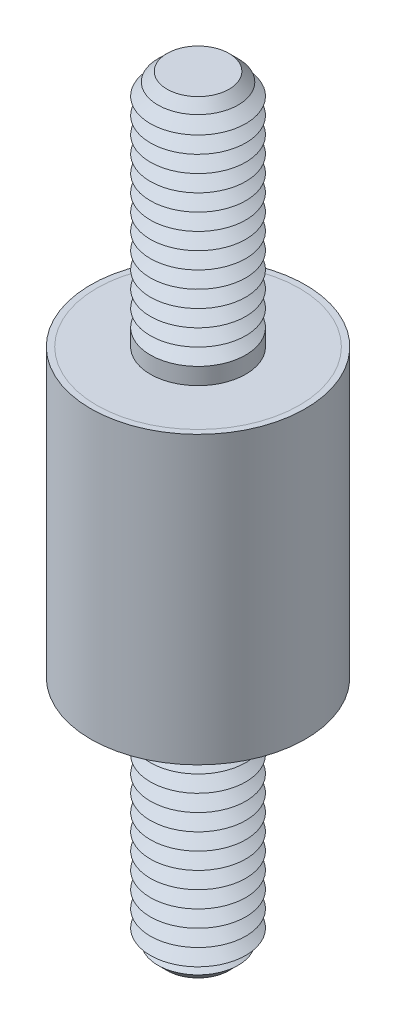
ISO-10303-21;
HEADER;
FILE_DESCRIPTION(('STEP AP214'),'2;1');
FILE_NAME('part.step','',(''),(''),'','','');
FILE_SCHEMA(('AUTOMOTIVE_DESIGN { 1 0 10303 214 1 1 1 1 }'));
ENDSEC;
DATA;
#1=APPLICATION_CONTEXT('core data for automotive mechanical design processes');
#2=APPLICATION_PROTOCOL_DEFINITION('international standard','automotive_design',2000,#1);
#3=PRODUCT_CONTEXT('',#1,'mechanical');
#4=PRODUCT('Part','Part','',(#3));
#5=PRODUCT_RELATED_PRODUCT_CATEGORY('part','',(#4));
#6=PRODUCT_DEFINITION_FORMATION('','',#4);
#7=PRODUCT_DEFINITION_CONTEXT('part definition',#1,'design');
#8=PRODUCT_DEFINITION('design','',#6,#7);
#9=PRODUCT_DEFINITION_SHAPE('','',#8);
#10=(LENGTH_UNIT() NAMED_UNIT(*) SI_UNIT(.MILLI.,.METRE.));
#11=(NAMED_UNIT(*) PLANE_ANGLE_UNIT() SI_UNIT($,.RADIAN.));
#12=(NAMED_UNIT(*) SI_UNIT($,.STERADIAN.) SOLID_ANGLE_UNIT());
#13=UNCERTAINTY_MEASURE_WITH_UNIT(LENGTH_MEASURE(1.E-05),#10,'distance_accuracy_value','');
#14=(GEOMETRIC_REPRESENTATION_CONTEXT(3) GLOBAL_UNCERTAINTY_ASSIGNED_CONTEXT((#13)) GLOBAL_UNIT_ASSIGNED_CONTEXT((#10,
#11,#12)) REPRESENTATION_CONTEXT('',''));
#15=CARTESIAN_POINT('',(0.,0.,0.));
#16=DIRECTION('',(0.,0.,1.));
#17=DIRECTION('',(1.,0.,0.));
#18=AXIS2_PLACEMENT_3D('',#15,#16,#17);
#19=CARTESIAN_POINT('',(0.,-16.,0.));
#20=DIRECTION('',(0.,1.,0.));
#21=DIRECTION('',(0.,0.,1.));
#22=AXIS2_PLACEMENT_3D('',#19,#20,#21);
#23=CYLINDRICAL_SURFACE('',#22,2.);
#24=CARTESIAN_POINT('',(0.,-6.,0.));
#25=DIRECTION('',(0.,-1.,0.));
#26=DIRECTION('',(0.,0.,-1.));
#27=AXIS2_PLACEMENT_3D('',#24,#25,#26);
#28=CIRCLE('',#27,2.);
#29=CARTESIAN_POINT('',(0.,-6.,-2.));
#30=VERTEX_POINT('',#29);
#31=EDGE_CURVE('P0_E22',#30,#30,#28,.T.);
#32=ORIENTED_EDGE('',*,*,#31,.T.);
#33=EDGE_LOOP('',(#32));
#34=FACE_BOUND('',#33,.T.);
#35=CARTESIAN_POINT('',(0.,-6.7,0.));
#36=DIRECTION('',(0.,1.,0.));
#37=DIRECTION('',(0.,0.,1.));
#38=AXIS2_PLACEMENT_3D('',#35,#36,#37);
#39=CIRCLE('',#38,2.);
#40=CARTESIAN_POINT('',(0.,-6.7,2.));
#41=VERTEX_POINT('',#40);
#42=EDGE_CURVE('P0_E32',#41,#41,#39,.T.);
#43=ORIENTED_EDGE('',*,*,#42,.T.);
#44=EDGE_LOOP('',(#43));
#45=FACE_BOUND('',#44,.T.);
#46=ADVANCED_FACE('P0_F14',(#34,#45),#23,.T.);
#47=CARTESIAN_POINT('',(0.,-6.,0.));
#48=DIRECTION('',(0.,1.,0.));
#49=DIRECTION('',(0.,0.,1.));
#50=AXIS2_PLACEMENT_3D('',#47,#48,#49);
#51=CYLINDRICAL_SURFACE('',#50,4.25);
#52=CARTESIAN_POINT('',(0.,-6.,0.));
#53=DIRECTION('',(0.,1.,0.));
#54=DIRECTION('',(0.,0.,1.));
#55=AXIS2_PLACEMENT_3D('',#52,#53,#54);
#56=CIRCLE('',#55,4.25);
#57=CARTESIAN_POINT('',(0.,-6.,4.25));
#58=VERTEX_POINT('',#57);
#59=EDGE_CURVE('P0_E26',#58,#58,#56,.T.);
#60=ORIENTED_EDGE('',*,*,#59,.T.);
#61=EDGE_LOOP('',(#60));
#62=FACE_BOUND('',#61,.T.);
#63=CARTESIAN_POINT('',(0.,-5.5,0.));
#64=DIRECTION('',(0.,1.,0.));
#65=DIRECTION('',(0.,0.,1.));
#66=AXIS2_PLACEMENT_3D('',#63,#64,#65);
#67=CIRCLE('',#66,4.25);
#68=CARTESIAN_POINT('',(0.,-5.5,4.25));
#69=VERTEX_POINT('',#68);
#70=EDGE_CURVE('P0_E29',#69,#69,#67,.T.);
#71=ORIENTED_EDGE('',*,*,#70,.F.);
#72=EDGE_LOOP('',(#71));
#73=FACE_BOUND('',#72,.T.);
#74=ADVANCED_FACE('P0_F131',(#62,#73),#51,.T.);
#75=CARTESIAN_POINT('',(0.,-6.,0.));
#76=DIRECTION('',(0.,1.,0.));
#77=DIRECTION('',(0.,0.,1.));
#78=AXIS2_PLACEMENT_3D('',#75,#76,#77);
#79=PLANE('',#78);
#80=ORIENTED_EDGE('',*,*,#31,.F.);
#81=EDGE_LOOP('',(#80));
#82=FACE_BOUND('',#81,.T.);
#83=ORIENTED_EDGE('',*,*,#59,.F.);
#84=EDGE_LOOP('',(#83));
#85=FACE_BOUND('',#84,.T.);
#86=ADVANCED_FACE('P0_F137',(#82,#85),#79,.F.);
#87=CARTESIAN_POINT('',(0.,-5.5,0.));
#88=DIRECTION('',(0.,1.,0.));
#89=DIRECTION('',(0.,0.,1.));
#90=AXIS2_PLACEMENT_3D('',#87,#88,#89);
#91=PLANE('',#90);
#92=ORIENTED_EDGE('',*,*,#70,.T.);
#93=EDGE_LOOP('',(#92));
#94=FACE_BOUND('',#93,.T.);
#95=ADVANCED_FACE('P0_F144',(#94),#91,.T.);
#96=CARTESIAN_POINT('',(0.,-6.7,0.));
#97=DIRECTION('',(0.,1.,0.));
#98=DIRECTION('',(0.,0.,1.));
#99=AXIS2_PLACEMENT_3D('',#96,#97,#98);
#100=CONICAL_SURFACE('',#99,2.,1.0471975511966);
#101=CARTESIAN_POINT('',(0.,-7.05,0.));
#102=DIRECTION('',(0.,1.,0.));
#103=DIRECTION('',(0.,0.,1.));
#104=AXIS2_PLACEMENT_3D('',#101,#102,#103);
#105=CIRCLE('',#104,1.39378221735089);
#106=CARTESIAN_POINT('',(0.,-7.05,1.39378221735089));
#107=VERTEX_POINT('',#106);
#108=EDGE_CURVE('P0_E37',#107,#107,#105,.T.);
#109=ORIENTED_EDGE('',*,*,#108,.T.);
#110=EDGE_LOOP('',(#109));
#111=FACE_BOUND('',#110,.T.);
#112=ORIENTED_EDGE('',*,*,#42,.F.);
#113=EDGE_LOOP('',(#112));
#114=FACE_BOUND('',#113,.T.);
#115=ADVANCED_FACE('P0_F147',(#111,#114),#100,.T.);
#116=CARTESIAN_POINT('',(0.,-7.05,0.));
#117=DIRECTION('',(0.,-1.,0.));
#118=DIRECTION('',(0.,0.,-1.));
#119=AXIS2_PLACEMENT_3D('',#116,#117,#118);
#120=CONICAL_SURFACE('',#119,1.39378221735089,1.0471975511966);
#121=CARTESIAN_POINT('',(0.,-7.4,0.));
#122=DIRECTION('',(0.,1.,0.));
#123=DIRECTION('',(0.,0.,1.));
#124=AXIS2_PLACEMENT_3D('',#121,#122,#123);
#125=CIRCLE('',#124,2.);
#126=CARTESIAN_POINT('',(0.,-7.4,2.));
#127=VERTEX_POINT('',#126);
#128=EDGE_CURVE('P0_E40',#127,#127,#125,.T.);
#129=ORIENTED_EDGE('',*,*,#128,.T.);
#130=EDGE_LOOP('',(#129));
#131=FACE_BOUND('',#130,.T.);
#132=ORIENTED_EDGE('',*,*,#108,.F.);
#133=EDGE_LOOP('',(#132));
#134=FACE_BOUND('',#133,.T.);
#135=ADVANCED_FACE('P0_F152',(#131,#134),#120,.T.);
#136=CARTESIAN_POINT('',(0.,-7.4,0.));
#137=DIRECTION('',(0.,1.,0.));
#138=DIRECTION('',(0.,0.,1.));
#139=AXIS2_PLACEMENT_3D('',#136,#137,#138);
#140=CONICAL_SURFACE('',#139,2.,1.0471975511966);
#141=CARTESIAN_POINT('',(0.,-7.75,0.));
#142=DIRECTION('',(0.,1.,0.));
#143=DIRECTION('',(0.,0.,1.));
#144=AXIS2_PLACEMENT_3D('',#141,#142,#143);
#145=CIRCLE('',#144,1.39378221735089);
#146=CARTESIAN_POINT('',(0.,-7.75,1.39378221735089));
#147=VERTEX_POINT('',#146);
#148=EDGE_CURVE('P0_E43',#147,#147,#145,.T.);
#149=ORIENTED_EDGE('',*,*,#148,.T.);
#150=EDGE_LOOP('',(#149));
#151=FACE_BOUND('',#150,.T.);
#152=ORIENTED_EDGE('',*,*,#128,.F.);
#153=EDGE_LOOP('',(#152));
#154=FACE_BOUND('',#153,.T.);
#155=ADVANCED_FACE('P0_F159',(#151,#154),#140,.T.);
#156=CARTESIAN_POINT('',(0.,-7.75,0.));
#157=DIRECTION('',(0.,-1.,0.));
#158=DIRECTION('',(0.,0.,-1.));
#159=AXIS2_PLACEMENT_3D('',#156,#157,#158);
#160=CONICAL_SURFACE('',#159,1.39378221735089,1.0471975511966);
#161=CARTESIAN_POINT('',(0.,-8.1,0.));
#162=DIRECTION('',(0.,1.,0.));
#163=DIRECTION('',(0.,0.,1.));
#164=AXIS2_PLACEMENT_3D('',#161,#162,#163);
#165=CIRCLE('',#164,2.);
#166=CARTESIAN_POINT('',(0.,-8.1,2.));
#167=VERTEX_POINT('',#166);
#168=EDGE_CURVE('P0_E46',#167,#167,#165,.T.);
#169=ORIENTED_EDGE('',*,*,#168,.T.);
#170=EDGE_LOOP('',(#169));
#171=FACE_BOUND('',#170,.T.);
#172=ORIENTED_EDGE('',*,*,#148,.F.);
#173=EDGE_LOOP('',(#172));
#174=FACE_BOUND('',#173,.T.);
#175=ADVANCED_FACE('P0_F166',(#171,#174),#160,.T.);
#176=CARTESIAN_POINT('',(0.,-8.1,0.));
#177=DIRECTION('',(0.,1.,0.));
#178=DIRECTION('',(0.,0.,1.));
#179=AXIS2_PLACEMENT_3D('',#176,#177,#178);
#180=CONICAL_SURFACE('',#179,2.,1.0471975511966);
#181=CARTESIAN_POINT('',(0.,-8.45,0.));
#182=DIRECTION('',(0.,1.,0.));
#183=DIRECTION('',(0.,0.,1.));
#184=AXIS2_PLACEMENT_3D('',#181,#182,#183);
#185=CIRCLE('',#184,1.39378221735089);
#186=CARTESIAN_POINT('',(0.,-8.45,1.39378221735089));
#187=VERTEX_POINT('',#186);
#188=EDGE_CURVE('P0_E49',#187,#187,#185,.T.);
#189=ORIENTED_EDGE('',*,*,#188,.T.);
#190=EDGE_LOOP('',(#189));
#191=FACE_BOUND('',#190,.T.);
#192=ORIENTED_EDGE('',*,*,#168,.F.);
#193=EDGE_LOOP('',(#192));
#194=FACE_BOUND('',#193,.T.);
#195=ADVANCED_FACE('P0_F170',(#191,#194),#180,.T.);
#196=CARTESIAN_POINT('',(0.,-8.45,0.));
#197=DIRECTION('',(0.,-1.,0.));
#198=DIRECTION('',(0.,0.,-1.));
#199=AXIS2_PLACEMENT_3D('',#196,#197,#198);
#200=CONICAL_SURFACE('',#199,1.39378221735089,1.0471975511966);
#201=CARTESIAN_POINT('',(0.,-8.8,0.));
#202=DIRECTION('',(0.,1.,0.));
#203=DIRECTION('',(0.,0.,1.));
#204=AXIS2_PLACEMENT_3D('',#201,#202,#203);
#205=CIRCLE('',#204,2.);
#206=CARTESIAN_POINT('',(0.,-8.8,2.));
#207=VERTEX_POINT('',#206);
#208=EDGE_CURVE('P0_E52',#207,#207,#205,.T.);
#209=ORIENTED_EDGE('',*,*,#208,.T.);
#210=EDGE_LOOP('',(#209));
#211=FACE_BOUND('',#210,.T.);
#212=ORIENTED_EDGE('',*,*,#188,.F.);
#213=EDGE_LOOP('',(#212));
#214=FACE_BOUND('',#213,.T.);
#215=ADVANCED_FACE('P0_F174',(#211,#214),#200,.T.);
#216=CARTESIAN_POINT('',(0.,-8.8,0.));
#217=DIRECTION('',(0.,1.,0.));
#218=DIRECTION('',(0.,0.,1.));
#219=AXIS2_PLACEMENT_3D('',#216,#217,#218);
#220=CONICAL_SURFACE('',#219,2.,1.0471975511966);
#221=CARTESIAN_POINT('',(0.,-9.15,0.));
#222=DIRECTION('',(0.,1.,0.));
#223=DIRECTION('',(0.,0.,1.));
#224=AXIS2_PLACEMENT_3D('',#221,#222,#223);
#225=CIRCLE('',#224,1.39378221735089);
#226=CARTESIAN_POINT('',(0.,-9.15,1.39378221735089));
#227=VERTEX_POINT('',#226);
#228=EDGE_CURVE('P0_E55',#227,#227,#225,.T.);
#229=ORIENTED_EDGE('',*,*,#228,.T.);
#230=EDGE_LOOP('',(#229));
#231=FACE_BOUND('',#230,.T.);
#232=ORIENTED_EDGE('',*,*,#208,.F.);
#233=EDGE_LOOP('',(#232));
#234=FACE_BOUND('',#233,.T.);
#235=ADVANCED_FACE('P0_F178',(#231,#234),#220,.T.);
#236=CARTESIAN_POINT('',(0.,-9.15,0.));
#237=DIRECTION('',(0.,-1.,0.));
#238=DIRECTION('',(0.,0.,-1.));
#239=AXIS2_PLACEMENT_3D('',#236,#237,#238);
#240=CONICAL_SURFACE('',#239,1.39378221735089,1.0471975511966);
#241=CARTESIAN_POINT('',(0.,-9.5,0.));
#242=DIRECTION('',(0.,1.,0.));
#243=DIRECTION('',(0.,0.,1.));
#244=AXIS2_PLACEMENT_3D('',#241,#242,#243);
#245=CIRCLE('',#244,2.);
#246=CARTESIAN_POINT('',(0.,-9.5,2.));
#247=VERTEX_POINT('',#246);
#248=EDGE_CURVE('P0_E58',#247,#247,#245,.T.);
#249=ORIENTED_EDGE('',*,*,#248,.T.);
#250=EDGE_LOOP('',(#249));
#251=FACE_BOUND('',#250,.T.);
#252=ORIENTED_EDGE('',*,*,#228,.F.);
#253=EDGE_LOOP('',(#252));
#254=FACE_BOUND('',#253,.T.);
#255=ADVANCED_FACE('P0_F182',(#251,#254),#240,.T.);
#256=CARTESIAN_POINT('',(0.,-9.5,0.));
#257=DIRECTION('',(0.,1.,0.));
#258=DIRECTION('',(0.,0.,1.));
#259=AXIS2_PLACEMENT_3D('',#256,#257,#258);
#260=CONICAL_SURFACE('',#259,2.,1.0471975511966);
#261=CARTESIAN_POINT('',(0.,-9.85,0.));
#262=DIRECTION('',(0.,1.,0.));
#263=DIRECTION('',(0.,0.,1.));
#264=AXIS2_PLACEMENT_3D('',#261,#262,#263);
#265=CIRCLE('',#264,1.39378221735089);
#266=CARTESIAN_POINT('',(0.,-9.85,1.39378221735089));
#267=VERTEX_POINT('',#266);
#268=EDGE_CURVE('P0_E61',#267,#267,#265,.T.);
#269=ORIENTED_EDGE('',*,*,#268,.T.);
#270=EDGE_LOOP('',(#269));
#271=FACE_BOUND('',#270,.T.);
#272=ORIENTED_EDGE('',*,*,#248,.F.);
#273=EDGE_LOOP('',(#272));
#274=FACE_BOUND('',#273,.T.);
#275=ADVANCED_FACE('P0_F186',(#271,#274),#260,.T.);
#276=CARTESIAN_POINT('',(0.,-9.85,0.));
#277=DIRECTION('',(0.,-1.,0.));
#278=DIRECTION('',(0.,0.,-1.));
#279=AXIS2_PLACEMENT_3D('',#276,#277,#278);
#280=CONICAL_SURFACE('',#279,1.39378221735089,1.0471975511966);
#281=CARTESIAN_POINT('',(0.,-10.2,0.));
#282=DIRECTION('',(0.,1.,0.));
#283=DIRECTION('',(0.,0.,1.));
#284=AXIS2_PLACEMENT_3D('',#281,#282,#283);
#285=CIRCLE('',#284,2.);
#286=CARTESIAN_POINT('',(0.,-10.2,2.));
#287=VERTEX_POINT('',#286);
#288=EDGE_CURVE('P0_E64',#287,#287,#285,.T.);
#289=ORIENTED_EDGE('',*,*,#288,.T.);
#290=EDGE_LOOP('',(#289));
#291=FACE_BOUND('',#290,.T.);
#292=ORIENTED_EDGE('',*,*,#268,.F.);
#293=EDGE_LOOP('',(#292));
#294=FACE_BOUND('',#293,.T.);
#295=ADVANCED_FACE('P0_F190',(#291,#294),#280,.T.);
#296=CARTESIAN_POINT('',(0.,-10.2,0.));
#297=DIRECTION('',(0.,1.,0.));
#298=DIRECTION('',(0.,0.,1.));
#299=AXIS2_PLACEMENT_3D('',#296,#297,#298);
#300=CONICAL_SURFACE('',#299,2.,1.0471975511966);
#301=CARTESIAN_POINT('',(0.,-10.55,0.));
#302=DIRECTION('',(0.,1.,0.));
#303=DIRECTION('',(0.,0.,1.));
#304=AXIS2_PLACEMENT_3D('',#301,#302,#303);
#305=CIRCLE('',#304,1.39378221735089);
#306=CARTESIAN_POINT('',(0.,-10.55,1.39378221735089));
#307=VERTEX_POINT('',#306);
#308=EDGE_CURVE('P0_E67',#307,#307,#305,.T.);
#309=ORIENTED_EDGE('',*,*,#308,.T.);
#310=EDGE_LOOP('',(#309));
#311=FACE_BOUND('',#310,.T.);
#312=ORIENTED_EDGE('',*,*,#288,.F.);
#313=EDGE_LOOP('',(#312));
#314=FACE_BOUND('',#313,.T.);
#315=ADVANCED_FACE('P0_F194',(#311,#314),#300,.T.);
#316=CARTESIAN_POINT('',(0.,-10.55,0.));
#317=DIRECTION('',(0.,-1.,0.));
#318=DIRECTION('',(0.,0.,-1.));
#319=AXIS2_PLACEMENT_3D('',#316,#317,#318);
#320=CONICAL_SURFACE('',#319,1.39378221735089,1.0471975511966);
#321=CARTESIAN_POINT('',(0.,-10.9,0.));
#322=DIRECTION('',(0.,1.,0.));
#323=DIRECTION('',(0.,0.,1.));
#324=AXIS2_PLACEMENT_3D('',#321,#322,#323);
#325=CIRCLE('',#324,2.);
#326=CARTESIAN_POINT('',(0.,-10.9,2.));
#327=VERTEX_POINT('',#326);
#328=EDGE_CURVE('P0_E70',#327,#327,#325,.T.);
#329=ORIENTED_EDGE('',*,*,#328,.T.);
#330=EDGE_LOOP('',(#329));
#331=FACE_BOUND('',#330,.T.);
#332=ORIENTED_EDGE('',*,*,#308,.F.);
#333=EDGE_LOOP('',(#332));
#334=FACE_BOUND('',#333,.T.);
#335=ADVANCED_FACE('P0_F198',(#331,#334),#320,.T.);
#336=CARTESIAN_POINT('',(0.,-10.9,0.));
#337=DIRECTION('',(0.,1.,0.));
#338=DIRECTION('',(0.,0.,1.));
#339=AXIS2_PLACEMENT_3D('',#336,#337,#338);
#340=CONICAL_SURFACE('',#339,2.,1.0471975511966);
#341=CARTESIAN_POINT('',(0.,-11.25,0.));
#342=DIRECTION('',(0.,1.,0.));
#343=DIRECTION('',(0.,0.,1.));
#344=AXIS2_PLACEMENT_3D('',#341,#342,#343);
#345=CIRCLE('',#344,1.39378221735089);
#346=CARTESIAN_POINT('',(0.,-11.25,1.39378221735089));
#347=VERTEX_POINT('',#346);
#348=EDGE_CURVE('P0_E73',#347,#347,#345,.T.);
#349=ORIENTED_EDGE('',*,*,#348,.T.);
#350=EDGE_LOOP('',(#349));
#351=FACE_BOUND('',#350,.T.);
#352=ORIENTED_EDGE('',*,*,#328,.F.);
#353=EDGE_LOOP('',(#352));
#354=FACE_BOUND('',#353,.T.);
#355=ADVANCED_FACE('P0_F202',(#351,#354),#340,.T.);
#356=CARTESIAN_POINT('',(0.,-11.25,0.));
#357=DIRECTION('',(0.,-1.,0.));
#358=DIRECTION('',(0.,0.,-1.));
#359=AXIS2_PLACEMENT_3D('',#356,#357,#358);
#360=CONICAL_SURFACE('',#359,1.39378221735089,1.0471975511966);
#361=CARTESIAN_POINT('',(0.,-11.6,0.));
#362=DIRECTION('',(0.,1.,0.));
#363=DIRECTION('',(0.,0.,1.));
#364=AXIS2_PLACEMENT_3D('',#361,#362,#363);
#365=CIRCLE('',#364,2.);
#366=CARTESIAN_POINT('',(0.,-11.6,2.));
#367=VERTEX_POINT('',#366);
#368=EDGE_CURVE('P0_E76',#367,#367,#365,.T.);
#369=ORIENTED_EDGE('',*,*,#368,.T.);
#370=EDGE_LOOP('',(#369));
#371=FACE_BOUND('',#370,.T.);
#372=ORIENTED_EDGE('',*,*,#348,.F.);
#373=EDGE_LOOP('',(#372));
#374=FACE_BOUND('',#373,.T.);
#375=ADVANCED_FACE('P0_F206',(#371,#374),#360,.T.);
#376=CARTESIAN_POINT('',(0.,-11.6,0.));
#377=DIRECTION('',(0.,1.,0.));
#378=DIRECTION('',(0.,0.,1.));
#379=AXIS2_PLACEMENT_3D('',#376,#377,#378);
#380=CONICAL_SURFACE('',#379,2.,1.0471975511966);
#381=CARTESIAN_POINT('',(0.,-11.95,0.));
#382=DIRECTION('',(0.,1.,0.));
#383=DIRECTION('',(0.,0.,1.));
#384=AXIS2_PLACEMENT_3D('',#381,#382,#383);
#385=CIRCLE('',#384,1.39378221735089);
#386=CARTESIAN_POINT('',(0.,-11.95,1.39378221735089));
#387=VERTEX_POINT('',#386);
#388=EDGE_CURVE('P0_E79',#387,#387,#385,.T.);
#389=ORIENTED_EDGE('',*,*,#388,.T.);
#390=EDGE_LOOP('',(#389));
#391=FACE_BOUND('',#390,.T.);
#392=ORIENTED_EDGE('',*,*,#368,.F.);
#393=EDGE_LOOP('',(#392));
#394=FACE_BOUND('',#393,.T.);
#395=ADVANCED_FACE('P0_F210',(#391,#394),#380,.T.);
#396=CARTESIAN_POINT('',(0.,-11.95,0.));
#397=DIRECTION('',(0.,-1.,0.));
#398=DIRECTION('',(0.,0.,-1.));
#399=AXIS2_PLACEMENT_3D('',#396,#397,#398);
#400=CONICAL_SURFACE('',#399,1.39378221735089,1.0471975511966);
#401=CARTESIAN_POINT('',(0.,-12.3,0.));
#402=DIRECTION('',(0.,1.,0.));
#403=DIRECTION('',(0.,0.,1.));
#404=AXIS2_PLACEMENT_3D('',#401,#402,#403);
#405=CIRCLE('',#404,2.);
#406=CARTESIAN_POINT('',(0.,-12.3,2.));
#407=VERTEX_POINT('',#406);
#408=EDGE_CURVE('P0_E82',#407,#407,#405,.T.);
#409=ORIENTED_EDGE('',*,*,#408,.T.);
#410=EDGE_LOOP('',(#409));
#411=FACE_BOUND('',#410,.T.);
#412=ORIENTED_EDGE('',*,*,#388,.F.);
#413=EDGE_LOOP('',(#412));
#414=FACE_BOUND('',#413,.T.);
#415=ADVANCED_FACE('P0_F214',(#411,#414),#400,.T.);
#416=CARTESIAN_POINT('',(0.,-12.3,0.));
#417=DIRECTION('',(0.,1.,0.));
#418=DIRECTION('',(0.,0.,1.));
#419=AXIS2_PLACEMENT_3D('',#416,#417,#418);
#420=CONICAL_SURFACE('',#419,2.,1.0471975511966);
#421=CARTESIAN_POINT('',(0.,-12.65,0.));
#422=DIRECTION('',(0.,1.,0.));
#423=DIRECTION('',(0.,0.,1.));
#424=AXIS2_PLACEMENT_3D('',#421,#422,#423);
#425=CIRCLE('',#424,1.39378221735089);
#426=CARTESIAN_POINT('',(0.,-12.65,1.39378221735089));
#427=VERTEX_POINT('',#426);
#428=EDGE_CURVE('P0_E85',#427,#427,#425,.T.);
#429=ORIENTED_EDGE('',*,*,#428,.T.);
#430=EDGE_LOOP('',(#429));
#431=FACE_BOUND('',#430,.T.);
#432=ORIENTED_EDGE('',*,*,#408,.F.);
#433=EDGE_LOOP('',(#432));
#434=FACE_BOUND('',#433,.T.);
#435=ADVANCED_FACE('P0_F218',(#431,#434),#420,.T.);
#436=CARTESIAN_POINT('',(0.,-12.65,0.));
#437=DIRECTION('',(0.,-1.,0.));
#438=DIRECTION('',(0.,0.,-1.));
#439=AXIS2_PLACEMENT_3D('',#436,#437,#438);
#440=CONICAL_SURFACE('',#439,1.39378221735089,1.0471975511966);
#441=CARTESIAN_POINT('',(0.,-13.,0.));
#442=DIRECTION('',(0.,1.,0.));
#443=DIRECTION('',(0.,0.,1.));
#444=AXIS2_PLACEMENT_3D('',#441,#442,#443);
#445=CIRCLE('',#444,2.);
#446=CARTESIAN_POINT('',(0.,-13.,2.));
#447=VERTEX_POINT('',#446);
#448=EDGE_CURVE('P0_E88',#447,#447,#445,.T.);
#449=ORIENTED_EDGE('',*,*,#448,.T.);
#450=EDGE_LOOP('',(#449));
#451=FACE_BOUND('',#450,.T.);
#452=ORIENTED_EDGE('',*,*,#428,.F.);
#453=EDGE_LOOP('',(#452));
#454=FACE_BOUND('',#453,.T.);
#455=ADVANCED_FACE('P0_F222',(#451,#454),#440,.T.);
#456=CARTESIAN_POINT('',(0.,-13.,0.));
#457=DIRECTION('',(0.,1.,0.));
#458=DIRECTION('',(0.,0.,1.));
#459=AXIS2_PLACEMENT_3D('',#456,#457,#458);
#460=CONICAL_SURFACE('',#459,2.,1.0471975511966);
#461=CARTESIAN_POINT('',(0.,-13.35,0.));
#462=DIRECTION('',(0.,1.,0.));
#463=DIRECTION('',(0.,0.,1.));
#464=AXIS2_PLACEMENT_3D('',#461,#462,#463);
#465=CIRCLE('',#464,1.39378221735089);
#466=CARTESIAN_POINT('',(0.,-13.35,1.39378221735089));
#467=VERTEX_POINT('',#466);
#468=EDGE_CURVE('P0_E91',#467,#467,#465,.T.);
#469=ORIENTED_EDGE('',*,*,#468,.T.);
#470=EDGE_LOOP('',(#469));
#471=FACE_BOUND('',#470,.T.);
#472=ORIENTED_EDGE('',*,*,#448,.F.);
#473=EDGE_LOOP('',(#472));
#474=FACE_BOUND('',#473,.T.);
#475=ADVANCED_FACE('P0_F226',(#471,#474),#460,.T.);
#476=CARTESIAN_POINT('',(0.,-13.35,0.));
#477=DIRECTION('',(0.,-1.,0.));
#478=DIRECTION('',(0.,0.,-1.));
#479=AXIS2_PLACEMENT_3D('',#476,#477,#478);
#480=CONICAL_SURFACE('',#479,1.39378221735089,1.0471975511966);
#481=CARTESIAN_POINT('',(0.,-13.7,0.));
#482=DIRECTION('',(0.,1.,0.));
#483=DIRECTION('',(0.,0.,1.));
#484=AXIS2_PLACEMENT_3D('',#481,#482,#483);
#485=CIRCLE('',#484,2.);
#486=CARTESIAN_POINT('',(0.,-13.7,2.));
#487=VERTEX_POINT('',#486);
#488=EDGE_CURVE('P0_E94',#487,#487,#485,.T.);
#489=ORIENTED_EDGE('',*,*,#488,.T.);
#490=EDGE_LOOP('',(#489));
#491=FACE_BOUND('',#490,.T.);
#492=ORIENTED_EDGE('',*,*,#468,.F.);
#493=EDGE_LOOP('',(#492));
#494=FACE_BOUND('',#493,.T.);
#495=ADVANCED_FACE('P0_F230',(#491,#494),#480,.T.);
#496=CARTESIAN_POINT('',(0.,-13.7,0.));
#497=DIRECTION('',(0.,1.,0.));
#498=DIRECTION('',(0.,0.,1.));
#499=AXIS2_PLACEMENT_3D('',#496,#497,#498);
#500=CONICAL_SURFACE('',#499,2.,1.0471975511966);
#501=CARTESIAN_POINT('',(0.,-14.05,0.));
#502=DIRECTION('',(0.,1.,0.));
#503=DIRECTION('',(0.,0.,1.));
#504=AXIS2_PLACEMENT_3D('',#501,#502,#503);
#505=CIRCLE('',#504,1.39378221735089);
#506=CARTESIAN_POINT('',(0.,-14.05,1.39378221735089));
#507=VERTEX_POINT('',#506);
#508=EDGE_CURVE('P0_E97',#507,#507,#505,.T.);
#509=ORIENTED_EDGE('',*,*,#508,.T.);
#510=EDGE_LOOP('',(#509));
#511=FACE_BOUND('',#510,.T.);
#512=ORIENTED_EDGE('',*,*,#488,.F.);
#513=EDGE_LOOP('',(#512));
#514=FACE_BOUND('',#513,.T.);
#515=ADVANCED_FACE('P0_F234',(#511,#514),#500,.T.);
#516=CARTESIAN_POINT('',(0.,-14.05,0.));
#517=DIRECTION('',(0.,-1.,0.));
#518=DIRECTION('',(0.,0.,-1.));
#519=AXIS2_PLACEMENT_3D('',#516,#517,#518);
#520=CONICAL_SURFACE('',#519,1.39378221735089,1.0471975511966);
#521=CARTESIAN_POINT('',(0.,-14.4,0.));
#522=DIRECTION('',(0.,1.,0.));
#523=DIRECTION('',(0.,0.,1.));
#524=AXIS2_PLACEMENT_3D('',#521,#522,#523);
#525=CIRCLE('',#524,2.);
#526=CARTESIAN_POINT('',(0.,-14.4,2.));
#527=VERTEX_POINT('',#526);
#528=EDGE_CURVE('P0_E100',#527,#527,#525,.T.);
#529=ORIENTED_EDGE('',*,*,#528,.T.);
#530=EDGE_LOOP('',(#529));
#531=FACE_BOUND('',#530,.T.);
#532=ORIENTED_EDGE('',*,*,#508,.F.);
#533=EDGE_LOOP('',(#532));
#534=FACE_BOUND('',#533,.T.);
#535=ADVANCED_FACE('P0_F238',(#531,#534),#520,.T.);
#536=CARTESIAN_POINT('',(0.,-14.4,0.));
#537=DIRECTION('',(0.,1.,0.));
#538=DIRECTION('',(0.,0.,1.));
#539=AXIS2_PLACEMENT_3D('',#536,#537,#538);
#540=CONICAL_SURFACE('',#539,2.,1.0471975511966);
#541=CARTESIAN_POINT('',(0.,-14.75,0.));
#542=DIRECTION('',(0.,1.,0.));
#543=DIRECTION('',(0.,0.,1.));
#544=AXIS2_PLACEMENT_3D('',#541,#542,#543);
#545=CIRCLE('',#544,1.39378221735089);
#546=CARTESIAN_POINT('',(0.,-14.75,1.39378221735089));
#547=VERTEX_POINT('',#546);
#548=EDGE_CURVE('P0_E103',#547,#547,#545,.T.);
#549=ORIENTED_EDGE('',*,*,#548,.T.);
#550=EDGE_LOOP('',(#549));
#551=FACE_BOUND('',#550,.T.);
#552=ORIENTED_EDGE('',*,*,#528,.F.);
#553=EDGE_LOOP('',(#552));
#554=FACE_BOUND('',#553,.T.);
#555=ADVANCED_FACE('P0_F242',(#551,#554),#540,.T.);
#556=CARTESIAN_POINT('',(0.,-14.75,0.));
#557=DIRECTION('',(0.,-1.,0.));
#558=DIRECTION('',(0.,0.,-1.));
#559=AXIS2_PLACEMENT_3D('',#556,#557,#558);
#560=CONICAL_SURFACE('',#559,1.39378221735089,1.0471975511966);
#561=CARTESIAN_POINT('',(0.,-15.1,0.));
#562=DIRECTION('',(0.,1.,0.));
#563=DIRECTION('',(0.,0.,1.));
#564=AXIS2_PLACEMENT_3D('',#561,#562,#563);
#565=CIRCLE('',#564,2.);
#566=CARTESIAN_POINT('',(0.,-15.1,2.));
#567=VERTEX_POINT('',#566);
#568=EDGE_CURVE('P0_E106',#567,#567,#565,.T.);
#569=ORIENTED_EDGE('',*,*,#568,.T.);
#570=EDGE_LOOP('',(#569));
#571=FACE_BOUND('',#570,.T.);
#572=ORIENTED_EDGE('',*,*,#548,.F.);
#573=EDGE_LOOP('',(#572));
#574=FACE_BOUND('',#573,.T.);
#575=ADVANCED_FACE('P0_F127',(#571,#574),#560,.T.);
#576=CARTESIAN_POINT('',(0.,-15.1,0.));
#577=DIRECTION('',(0.,1.,0.));
#578=DIRECTION('',(0.,0.,1.));
#579=AXIS2_PLACEMENT_3D('',#576,#577,#578);
#580=CONICAL_SURFACE('',#579,2.,1.0471975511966);
#581=CARTESIAN_POINT('',(0.,-15.45,0.));
#582=DIRECTION('',(0.,1.,0.));
#583=DIRECTION('',(0.,0.,1.));
#584=AXIS2_PLACEMENT_3D('',#581,#582,#583);
#585=CIRCLE('',#584,1.39378221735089);
#586=CARTESIAN_POINT('',(0.,-15.45,1.39378221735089));
#587=VERTEX_POINT('',#586);
#588=EDGE_CURVE('P0_E109',#587,#587,#585,.T.);
#589=ORIENTED_EDGE('',*,*,#588,.T.);
#590=EDGE_LOOP('',(#589));
#591=FACE_BOUND('',#590,.T.);
#592=ORIENTED_EDGE('',*,*,#568,.F.);
#593=EDGE_LOOP('',(#592));
#594=FACE_BOUND('',#593,.T.);
#595=ADVANCED_FACE('P0_F113',(#591,#594),#580,.T.);
#596=CARTESIAN_POINT('',(0.,-15.45,0.));
#597=DIRECTION('',(0.,-1.,0.));
#598=DIRECTION('',(0.,0.,-1.));
#599=AXIS2_PLACEMENT_3D('',#596,#597,#598);
#600=CONICAL_SURFACE('',#599,1.39378221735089,1.0471975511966);
#601=CARTESIAN_POINT('',(0.,-15.6169872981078,0.));
#602=DIRECTION('',(0.,-1.,0.));
#603=DIRECTION('',(0.,0.,-1.));
#604=AXIS2_PLACEMENT_3D('',#601,#602,#603);
#605=CIRCLE('',#604,1.68301270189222);
#606=CARTESIAN_POINT('',(0.,-15.6169872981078,-1.68301270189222));
#607=VERTEX_POINT('',#606);
#608=EDGE_CURVE('P0_E18',#607,#607,#605,.T.);
#609=ORIENTED_EDGE('',*,*,#608,.F.);
#610=EDGE_LOOP('',(#609));
#611=FACE_BOUND('',#610,.T.);
#612=ORIENTED_EDGE('',*,*,#588,.F.);
#613=EDGE_LOOP('',(#612));
#614=FACE_BOUND('',#613,.T.);
#615=ADVANCED_FACE('P0_F116',(#611,#614),#600,.T.);
#616=CARTESIAN_POINT('',(0.,-16.,0.));
#617=DIRECTION('',(0.,-1.,0.));
#618=DIRECTION('',(0.,0.,-1.));
#619=AXIS2_PLACEMENT_3D('',#616,#617,#618);
#620=PLANE('',#619);
#621=CARTESIAN_POINT('',(0.,-16.,0.));
#622=DIRECTION('',(0.,-1.,0.));
#623=DIRECTION('',(0.,0.,-1.));
#624=AXIS2_PLACEMENT_3D('',#621,#622,#623);
#625=CIRCLE('',#624,1.3);
#626=CARTESIAN_POINT('',(0.,-16.,-1.3));
#627=VERTEX_POINT('',#626);
#628=EDGE_CURVE('P0_E10',#627,#627,#625,.T.);
#629=ORIENTED_EDGE('',*,*,#628,.T.);
#630=EDGE_LOOP('',(#629));
#631=FACE_BOUND('',#630,.T.);
#632=ADVANCED_FACE('P0_F118',(#631),#620,.T.);
#633=CARTESIAN_POINT('',(0.,-16.,0.));
#634=DIRECTION('',(0.,1.,0.));
#635=DIRECTION('',(0.,0.,1.));
#636=AXIS2_PLACEMENT_3D('',#633,#634,#635);
#637=CONICAL_SURFACE('',#636,1.3,0.785398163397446);
#638=ORIENTED_EDGE('',*,*,#628,.F.);
#639=EDGE_LOOP('',(#638));
#640=FACE_BOUND('',#639,.T.);
#641=ORIENTED_EDGE('',*,*,#608,.T.);
#642=EDGE_LOOP('',(#641));
#643=FACE_BOUND('',#642,.T.);
#644=ADVANCED_FACE('P0_F16',(#640,#643),#637,.T.);
#645=CLOSED_SHELL('',(#46,#74,#86,#95,#115,#135,#155,#175,#195,#215,#235,#255,#275,#295,#315,
#335,#355,#375,#395,#415,#435,#455,#475,#495,#515,#535,#555,#575,#595,#615,#632,#644));
#646=MANIFOLD_SOLID_BREP('P0_B1',#645);
#647=CARTESIAN_POINT('',(0.,16.,0.));
#648=DIRECTION('',(0.,-1.,0.));
#649=DIRECTION('',(0.,0.,-1.));
#650=AXIS2_PLACEMENT_3D('',#647,#648,#649);
#651=CYLINDRICAL_SURFACE('',#650,2.);
#652=CARTESIAN_POINT('',(0.,6.7,0.));
#653=DIRECTION('',(0.,1.,0.));
#654=DIRECTION('',(0.,0.,1.));
#655=AXIS2_PLACEMENT_3D('',#652,#653,#654);
#656=CIRCLE('',#655,2.);
#657=CARTESIAN_POINT('',(0.,6.7,2.));
#658=VERTEX_POINT('',#657);
#659=EDGE_CURVE('P1_E32',#658,#658,#656,.T.);
#660=ORIENTED_EDGE('',*,*,#659,.F.);
#661=EDGE_LOOP('',(#660));
#662=FACE_BOUND('',#661,.T.);
#663=CARTESIAN_POINT('',(0.,6.,0.));
#664=DIRECTION('',(0.,1.,0.));
#665=DIRECTION('',(0.,0.,1.));
#666=AXIS2_PLACEMENT_3D('',#663,#664,#665);
#667=CIRCLE('',#666,2.);
#668=CARTESIAN_POINT('',(0.,6.,2.));
#669=VERTEX_POINT('',#668);
#670=EDGE_CURVE('P1_E22',#669,#669,#667,.T.);
#671=ORIENTED_EDGE('',*,*,#670,.T.);
#672=EDGE_LOOP('',(#671));
#673=FACE_BOUND('',#672,.T.);
#674=ADVANCED_FACE('P1_F14',(#662,#673),#651,.T.);
#675=CARTESIAN_POINT('',(0.,6.,0.));
#676=DIRECTION('',(0.,-1.,0.));
#677=DIRECTION('',(0.,0.,-1.));
#678=AXIS2_PLACEMENT_3D('',#675,#676,#677);
#679=CYLINDRICAL_SURFACE('',#678,4.25);
#680=CARTESIAN_POINT('',(0.,6.,0.));
#681=DIRECTION('',(0.,1.,0.));
#682=DIRECTION('',(0.,0.,1.));
#683=AXIS2_PLACEMENT_3D('',#680,#681,#682);
#684=CIRCLE('',#683,4.25);
#685=CARTESIAN_POINT('',(0.,6.,4.25));
#686=VERTEX_POINT('',#685);
#687=EDGE_CURVE('P1_E26',#686,#686,#684,.T.);
#688=ORIENTED_EDGE('',*,*,#687,.F.);
#689=EDGE_LOOP('',(#688));
#690=FACE_BOUND('',#689,.T.);
#691=CARTESIAN_POINT('',(0.,5.5,0.));
#692=DIRECTION('',(0.,1.,0.));
#693=DIRECTION('',(0.,0.,1.));
#694=AXIS2_PLACEMENT_3D('',#691,#692,#693);
#695=CIRCLE('',#694,4.25);
#696=CARTESIAN_POINT('',(0.,5.5,4.25));
#697=VERTEX_POINT('',#696);
#698=EDGE_CURVE('P1_E29',#697,#697,#695,.T.);
#699=ORIENTED_EDGE('',*,*,#698,.T.);
#700=EDGE_LOOP('',(#699));
#701=FACE_BOUND('',#700,.T.);
#702=ADVANCED_FACE('P1_F268',(#690,#701),#679,.T.);
#703=CARTESIAN_POINT('',(0.,6.,0.));
#704=DIRECTION('',(0.,1.,0.));
#705=DIRECTION('',(0.,0.,1.));
#706=AXIS2_PLACEMENT_3D('',#703,#704,#705);
#707=PLANE('',#706);
#708=ORIENTED_EDGE('',*,*,#670,.F.);
#709=EDGE_LOOP('',(#708));
#710=FACE_BOUND('',#709,.T.);
#711=ORIENTED_EDGE('',*,*,#687,.T.);
#712=EDGE_LOOP('',(#711));
#713=FACE_BOUND('',#712,.T.);
#714=ADVANCED_FACE('P1_F272',(#710,#713),#707,.T.);
#715=CARTESIAN_POINT('',(0.,5.5,0.));
#716=DIRECTION('',(0.,1.,0.));
#717=DIRECTION('',(0.,0.,1.));
#718=AXIS2_PLACEMENT_3D('',#715,#716,#717);
#719=PLANE('',#718);
#720=ORIENTED_EDGE('',*,*,#698,.F.);
#721=EDGE_LOOP('',(#720));
#722=FACE_BOUND('',#721,.T.);
#723=ADVANCED_FACE('P1_F262',(#722),#719,.F.);
#724=CARTESIAN_POINT('',(0.,6.7,0.));
#725=DIRECTION('',(0.,-1.,0.));
#726=DIRECTION('',(0.,0.,-1.));
#727=AXIS2_PLACEMENT_3D('',#724,#725,#726);
#728=CONICAL_SURFACE('',#727,2.,1.0471975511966);
#729=CARTESIAN_POINT('',(0.,7.05,0.));
#730=DIRECTION('',(0.,1.,0.));
#731=DIRECTION('',(0.,0.,1.));
#732=AXIS2_PLACEMENT_3D('',#729,#730,#731);
#733=CIRCLE('',#732,1.39378221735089);
#734=CARTESIAN_POINT('',(0.,7.05,1.39378221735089));
#735=VERTEX_POINT('',#734);
#736=EDGE_CURVE('P1_E37',#735,#735,#733,.T.);
#737=ORIENTED_EDGE('',*,*,#736,.F.);
#738=EDGE_LOOP('',(#737));
#739=FACE_BOUND('',#738,.T.);
#740=ORIENTED_EDGE('',*,*,#659,.T.);
#741=EDGE_LOOP('',(#740));
#742=FACE_BOUND('',#741,.T.);
#743=ADVANCED_FACE('P1_F256',(#739,#742),#728,.T.);
#744=CARTESIAN_POINT('',(0.,7.05,0.));
#745=DIRECTION('',(0.,1.,0.));
#746=DIRECTION('',(0.,0.,1.));
#747=AXIS2_PLACEMENT_3D('',#744,#745,#746);
#748=CONICAL_SURFACE('',#747,1.39378221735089,1.0471975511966);
#749=CARTESIAN_POINT('',(0.,7.4,0.));
#750=DIRECTION('',(0.,1.,0.));
#751=DIRECTION('',(0.,0.,1.));
#752=AXIS2_PLACEMENT_3D('',#749,#750,#751);
#753=CIRCLE('',#752,2.);
#754=CARTESIAN_POINT('',(0.,7.4,2.));
#755=VERTEX_POINT('',#754);
#756=EDGE_CURVE('P1_E40',#755,#755,#753,.T.);
#757=ORIENTED_EDGE('',*,*,#756,.F.);
#758=EDGE_LOOP('',(#757));
#759=FACE_BOUND('',#758,.T.);
#760=ORIENTED_EDGE('',*,*,#736,.T.);
#761=EDGE_LOOP('',(#760));
#762=FACE_BOUND('',#761,.T.);
#763=ADVANCED_FACE('P1_F250',(#759,#762),#748,.T.);
#764=CARTESIAN_POINT('',(0.,7.4,0.));
#765=DIRECTION('',(0.,-1.,0.));
#766=DIRECTION('',(0.,0.,-1.));
#767=AXIS2_PLACEMENT_3D('',#764,#765,#766);
#768=CONICAL_SURFACE('',#767,2.,1.0471975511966);
#769=CARTESIAN_POINT('',(0.,7.75,0.));
#770=DIRECTION('',(0.,1.,0.));
#771=DIRECTION('',(0.,0.,1.));
#772=AXIS2_PLACEMENT_3D('',#769,#770,#771);
#773=CIRCLE('',#772,1.39378221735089);
#774=CARTESIAN_POINT('',(0.,7.75,1.39378221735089));
#775=VERTEX_POINT('',#774);
#776=EDGE_CURVE('P1_E43',#775,#775,#773,.T.);
#777=ORIENTED_EDGE('',*,*,#776,.F.);
#778=EDGE_LOOP('',(#777));
#779=FACE_BOUND('',#778,.T.);
#780=ORIENTED_EDGE('',*,*,#756,.T.);
#781=EDGE_LOOP('',(#780));
#782=FACE_BOUND('',#781,.T.);
#783=ADVANCED_FACE('P1_F244',(#779,#782),#768,.T.);
#784=CARTESIAN_POINT('',(0.,7.75,0.));
#785=DIRECTION('',(0.,1.,0.));
#786=DIRECTION('',(0.,0.,1.));
#787=AXIS2_PLACEMENT_3D('',#784,#785,#786);
#788=CONICAL_SURFACE('',#787,1.39378221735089,1.0471975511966);
#789=CARTESIAN_POINT('',(0.,8.1,0.));
#790=DIRECTION('',(0.,1.,0.));
#791=DIRECTION('',(0.,0.,1.));
#792=AXIS2_PLACEMENT_3D('',#789,#790,#791);
#793=CIRCLE('',#792,2.);
#794=CARTESIAN_POINT('',(0.,8.1,2.));
#795=VERTEX_POINT('',#794);
#796=EDGE_CURVE('P1_E46',#795,#795,#793,.T.);
#797=ORIENTED_EDGE('',*,*,#796,.F.);
#798=EDGE_LOOP('',(#797));
#799=FACE_BOUND('',#798,.T.);
#800=ORIENTED_EDGE('',*,*,#776,.T.);
#801=EDGE_LOOP('',(#800));
#802=FACE_BOUND('',#801,.T.);
#803=ADVANCED_FACE('P1_F238',(#799,#802),#788,.T.);
#804=CARTESIAN_POINT('',(0.,8.1,0.));
#805=DIRECTION('',(0.,-1.,0.));
#806=DIRECTION('',(0.,0.,-1.));
#807=AXIS2_PLACEMENT_3D('',#804,#805,#806);
#808=CONICAL_SURFACE('',#807,2.,1.0471975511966);
#809=CARTESIAN_POINT('',(0.,8.45,0.));
#810=DIRECTION('',(0.,1.,0.));
#811=DIRECTION('',(0.,0.,1.));
#812=AXIS2_PLACEMENT_3D('',#809,#810,#811);
#813=CIRCLE('',#812,1.39378221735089);
#814=CARTESIAN_POINT('',(0.,8.45,1.39378221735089));
#815=VERTEX_POINT('',#814);
#816=EDGE_CURVE('P1_E49',#815,#815,#813,.T.);
#817=ORIENTED_EDGE('',*,*,#816,.F.);
#818=EDGE_LOOP('',(#817));
#819=FACE_BOUND('',#818,.T.);
#820=ORIENTED_EDGE('',*,*,#796,.T.);
#821=EDGE_LOOP('',(#820));
#822=FACE_BOUND('',#821,.T.);
#823=ADVANCED_FACE('P1_F232',(#819,#822),#808,.T.);
#824=CARTESIAN_POINT('',(0.,8.45,0.));
#825=DIRECTION('',(0.,1.,0.));
#826=DIRECTION('',(0.,0.,1.));
#827=AXIS2_PLACEMENT_3D('',#824,#825,#826);
#828=CONICAL_SURFACE('',#827,1.39378221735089,1.0471975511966);
#829=CARTESIAN_POINT('',(0.,8.8,0.));
#830=DIRECTION('',(0.,1.,0.));
#831=DIRECTION('',(0.,0.,1.));
#832=AXIS2_PLACEMENT_3D('',#829,#830,#831);
#833=CIRCLE('',#832,2.);
#834=CARTESIAN_POINT('',(0.,8.8,2.));
#835=VERTEX_POINT('',#834);
#836=EDGE_CURVE('P1_E52',#835,#835,#833,.T.);
#837=ORIENTED_EDGE('',*,*,#836,.F.);
#838=EDGE_LOOP('',(#837));
#839=FACE_BOUND('',#838,.T.);
#840=ORIENTED_EDGE('',*,*,#816,.T.);
#841=EDGE_LOOP('',(#840));
#842=FACE_BOUND('',#841,.T.);
#843=ADVANCED_FACE('P1_F226',(#839,#842),#828,.T.);
#844=CARTESIAN_POINT('',(0.,8.8,0.));
#845=DIRECTION('',(0.,-1.,0.));
#846=DIRECTION('',(0.,0.,-1.));
#847=AXIS2_PLACEMENT_3D('',#844,#845,#846);
#848=CONICAL_SURFACE('',#847,2.,1.0471975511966);
#849=CARTESIAN_POINT('',(0.,9.15,0.));
#850=DIRECTION('',(0.,1.,0.));
#851=DIRECTION('',(0.,0.,1.));
#852=AXIS2_PLACEMENT_3D('',#849,#850,#851);
#853=CIRCLE('',#852,1.39378221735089);
#854=CARTESIAN_POINT('',(0.,9.15,1.39378221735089));
#855=VERTEX_POINT('',#854);
#856=EDGE_CURVE('P1_E55',#855,#855,#853,.T.);
#857=ORIENTED_EDGE('',*,*,#856,.F.);
#858=EDGE_LOOP('',(#857));
#859=FACE_BOUND('',#858,.T.);
#860=ORIENTED_EDGE('',*,*,#836,.T.);
#861=EDGE_LOOP('',(#860));
#862=FACE_BOUND('',#861,.T.);
#863=ADVANCED_FACE('P1_F220',(#859,#862),#848,.T.);
#864=CARTESIAN_POINT('',(0.,9.15,0.));
#865=DIRECTION('',(0.,1.,0.));
#866=DIRECTION('',(0.,0.,1.));
#867=AXIS2_PLACEMENT_3D('',#864,#865,#866);
#868=CONICAL_SURFACE('',#867,1.39378221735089,1.0471975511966);
#869=CARTESIAN_POINT('',(0.,9.5,0.));
#870=DIRECTION('',(0.,1.,0.));
#871=DIRECTION('',(0.,0.,1.));
#872=AXIS2_PLACEMENT_3D('',#869,#870,#871);
#873=CIRCLE('',#872,2.);
#874=CARTESIAN_POINT('',(0.,9.5,2.));
#875=VERTEX_POINT('',#874);
#876=EDGE_CURVE('P1_E58',#875,#875,#873,.T.);
#877=ORIENTED_EDGE('',*,*,#876,.F.);
#878=EDGE_LOOP('',(#877));
#879=FACE_BOUND('',#878,.T.);
#880=ORIENTED_EDGE('',*,*,#856,.T.);
#881=EDGE_LOOP('',(#880));
#882=FACE_BOUND('',#881,.T.);
#883=ADVANCED_FACE('P1_F214',(#879,#882),#868,.T.);
#884=CARTESIAN_POINT('',(0.,9.5,0.));
#885=DIRECTION('',(0.,-1.,0.));
#886=DIRECTION('',(0.,0.,-1.));
#887=AXIS2_PLACEMENT_3D('',#884,#885,#886);
#888=CONICAL_SURFACE('',#887,2.,1.0471975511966);
#889=CARTESIAN_POINT('',(0.,9.85,0.));
#890=DIRECTION('',(0.,1.,0.));
#891=DIRECTION('',(0.,0.,1.));
#892=AXIS2_PLACEMENT_3D('',#889,#890,#891);
#893=CIRCLE('',#892,1.39378221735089);
#894=CARTESIAN_POINT('',(0.,9.85,1.39378221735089));
#895=VERTEX_POINT('',#894);
#896=EDGE_CURVE('P1_E61',#895,#895,#893,.T.);
#897=ORIENTED_EDGE('',*,*,#896,.F.);
#898=EDGE_LOOP('',(#897));
#899=FACE_BOUND('',#898,.T.);
#900=ORIENTED_EDGE('',*,*,#876,.T.);
#901=EDGE_LOOP('',(#900));
#902=FACE_BOUND('',#901,.T.);
#903=ADVANCED_FACE('P1_F208',(#899,#902),#888,.T.);
#904=CARTESIAN_POINT('',(0.,9.85,0.));
#905=DIRECTION('',(0.,1.,0.));
#906=DIRECTION('',(0.,0.,1.));
#907=AXIS2_PLACEMENT_3D('',#904,#905,#906);
#908=CONICAL_SURFACE('',#907,1.39378221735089,1.0471975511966);
#909=CARTESIAN_POINT('',(0.,10.2,0.));
#910=DIRECTION('',(0.,1.,0.));
#911=DIRECTION('',(0.,0.,1.));
#912=AXIS2_PLACEMENT_3D('',#909,#910,#911);
#913=CIRCLE('',#912,2.);
#914=CARTESIAN_POINT('',(0.,10.2,2.));
#915=VERTEX_POINT('',#914);
#916=EDGE_CURVE('P1_E64',#915,#915,#913,.T.);
#917=ORIENTED_EDGE('',*,*,#916,.F.);
#918=EDGE_LOOP('',(#917));
#919=FACE_BOUND('',#918,.T.);
#920=ORIENTED_EDGE('',*,*,#896,.T.);
#921=EDGE_LOOP('',(#920));
#922=FACE_BOUND('',#921,.T.);
#923=ADVANCED_FACE('P1_F202',(#919,#922),#908,.T.);
#924=CARTESIAN_POINT('',(0.,10.2,0.));
#925=DIRECTION('',(0.,-1.,0.));
#926=DIRECTION('',(0.,0.,-1.));
#927=AXIS2_PLACEMENT_3D('',#924,#925,#926);
#928=CONICAL_SURFACE('',#927,2.,1.0471975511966);
#929=CARTESIAN_POINT('',(0.,10.55,0.));
#930=DIRECTION('',(0.,1.,0.));
#931=DIRECTION('',(0.,0.,1.));
#932=AXIS2_PLACEMENT_3D('',#929,#930,#931);
#933=CIRCLE('',#932,1.39378221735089);
#934=CARTESIAN_POINT('',(0.,10.55,1.39378221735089));
#935=VERTEX_POINT('',#934);
#936=EDGE_CURVE('P1_E67',#935,#935,#933,.T.);
#937=ORIENTED_EDGE('',*,*,#936,.F.);
#938=EDGE_LOOP('',(#937));
#939=FACE_BOUND('',#938,.T.);
#940=ORIENTED_EDGE('',*,*,#916,.T.);
#941=EDGE_LOOP('',(#940));
#942=FACE_BOUND('',#941,.T.);
#943=ADVANCED_FACE('P1_F196',(#939,#942),#928,.T.);
#944=CARTESIAN_POINT('',(0.,10.55,0.));
#945=DIRECTION('',(0.,1.,0.));
#946=DIRECTION('',(0.,0.,1.));
#947=AXIS2_PLACEMENT_3D('',#944,#945,#946);
#948=CONICAL_SURFACE('',#947,1.39378221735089,1.0471975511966);
#949=CARTESIAN_POINT('',(0.,10.9,0.));
#950=DIRECTION('',(0.,1.,0.));
#951=DIRECTION('',(0.,0.,1.));
#952=AXIS2_PLACEMENT_3D('',#949,#950,#951);
#953=CIRCLE('',#952,2.);
#954=CARTESIAN_POINT('',(0.,10.9,2.));
#955=VERTEX_POINT('',#954);
#956=EDGE_CURVE('P1_E70',#955,#955,#953,.T.);
#957=ORIENTED_EDGE('',*,*,#956,.F.);
#958=EDGE_LOOP('',(#957));
#959=FACE_BOUND('',#958,.T.);
#960=ORIENTED_EDGE('',*,*,#936,.T.);
#961=EDGE_LOOP('',(#960));
#962=FACE_BOUND('',#961,.T.);
#963=ADVANCED_FACE('P1_F190',(#959,#962),#948,.T.);
#964=CARTESIAN_POINT('',(0.,10.9,0.));
#965=DIRECTION('',(0.,-1.,0.));
#966=DIRECTION('',(0.,0.,-1.));
#967=AXIS2_PLACEMENT_3D('',#964,#965,#966);
#968=CONICAL_SURFACE('',#967,2.,1.0471975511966);
#969=CARTESIAN_POINT('',(0.,11.25,0.));
#970=DIRECTION('',(0.,1.,0.));
#971=DIRECTION('',(0.,0.,1.));
#972=AXIS2_PLACEMENT_3D('',#969,#970,#971);
#973=CIRCLE('',#972,1.39378221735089);
#974=CARTESIAN_POINT('',(0.,11.25,1.39378221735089));
#975=VERTEX_POINT('',#974);
#976=EDGE_CURVE('P1_E73',#975,#975,#973,.T.);
#977=ORIENTED_EDGE('',*,*,#976,.F.);
#978=EDGE_LOOP('',(#977));
#979=FACE_BOUND('',#978,.T.);
#980=ORIENTED_EDGE('',*,*,#956,.T.);
#981=EDGE_LOOP('',(#980));
#982=FACE_BOUND('',#981,.T.);
#983=ADVANCED_FACE('P1_F184',(#979,#982),#968,.T.);
#984=CARTESIAN_POINT('',(0.,11.25,0.));
#985=DIRECTION('',(0.,1.,0.));
#986=DIRECTION('',(0.,0.,1.));
#987=AXIS2_PLACEMENT_3D('',#984,#985,#986);
#988=CONICAL_SURFACE('',#987,1.39378221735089,1.0471975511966);
#989=CARTESIAN_POINT('',(0.,11.6,0.));
#990=DIRECTION('',(0.,1.,0.));
#991=DIRECTION('',(0.,0.,1.));
#992=AXIS2_PLACEMENT_3D('',#989,#990,#991);
#993=CIRCLE('',#992,2.);
#994=CARTESIAN_POINT('',(0.,11.6,2.));
#995=VERTEX_POINT('',#994);
#996=EDGE_CURVE('P1_E76',#995,#995,#993,.T.);
#997=ORIENTED_EDGE('',*,*,#996,.F.);
#998=EDGE_LOOP('',(#997));
#999=FACE_BOUND('',#998,.T.);
#1000=ORIENTED_EDGE('',*,*,#976,.T.);
#1001=EDGE_LOOP('',(#1000));
#1002=FACE_BOUND('',#1001,.T.);
#1003=ADVANCED_FACE('P1_F178',(#999,#1002),#988,.T.);
#1004=CARTESIAN_POINT('',(0.,11.6,0.));
#1005=DIRECTION('',(0.,-1.,0.));
#1006=DIRECTION('',(0.,0.,-1.));
#1007=AXIS2_PLACEMENT_3D('',#1004,#1005,#1006);
#1008=CONICAL_SURFACE('',#1007,2.,1.0471975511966);
#1009=CARTESIAN_POINT('',(0.,11.95,0.));
#1010=DIRECTION('',(0.,1.,0.));
#1011=DIRECTION('',(0.,0.,1.));
#1012=AXIS2_PLACEMENT_3D('',#1009,#1010,#1011);
#1013=CIRCLE('',#1012,1.39378221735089);
#1014=CARTESIAN_POINT('',(0.,11.95,1.39378221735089));
#1015=VERTEX_POINT('',#1014);
#1016=EDGE_CURVE('P1_E79',#1015,#1015,#1013,.T.);
#1017=ORIENTED_EDGE('',*,*,#1016,.F.);
#1018=EDGE_LOOP('',(#1017));
#1019=FACE_BOUND('',#1018,.T.);
#1020=ORIENTED_EDGE('',*,*,#996,.T.);
#1021=EDGE_LOOP('',(#1020));
#1022=FACE_BOUND('',#1021,.T.);
#1023=ADVANCED_FACE('P1_F172',(#1019,#1022),#1008,.T.);
#1024=CARTESIAN_POINT('',(0.,11.95,0.));
#1025=DIRECTION('',(0.,1.,0.));
#1026=DIRECTION('',(0.,0.,1.));
#1027=AXIS2_PLACEMENT_3D('',#1024,#1025,#1026);
#1028=CONICAL_SURFACE('',#1027,1.39378221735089,1.0471975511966);
#1029=CARTESIAN_POINT('',(0.,12.3,0.));
#1030=DIRECTION('',(0.,1.,0.));
#1031=DIRECTION('',(0.,0.,1.));
#1032=AXIS2_PLACEMENT_3D('',#1029,#1030,#1031);
#1033=CIRCLE('',#1032,2.);
#1034=CARTESIAN_POINT('',(0.,12.3,2.));
#1035=VERTEX_POINT('',#1034);
#1036=EDGE_CURVE('P1_E82',#1035,#1035,#1033,.T.);
#1037=ORIENTED_EDGE('',*,*,#1036,.F.);
#1038=EDGE_LOOP('',(#1037));
#1039=FACE_BOUND('',#1038,.T.);
#1040=ORIENTED_EDGE('',*,*,#1016,.T.);
#1041=EDGE_LOOP('',(#1040));
#1042=FACE_BOUND('',#1041,.T.);
#1043=ADVANCED_FACE('P1_F166',(#1039,#1042),#1028,.T.);
#1044=CARTESIAN_POINT('',(0.,12.3,0.));
#1045=DIRECTION('',(0.,-1.,0.));
#1046=DIRECTION('',(0.,0.,-1.));
#1047=AXIS2_PLACEMENT_3D('',#1044,#1045,#1046);
#1048=CONICAL_SURFACE('',#1047,2.,1.0471975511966);
#1049=CARTESIAN_POINT('',(0.,12.65,0.));
#1050=DIRECTION('',(0.,1.,0.));
#1051=DIRECTION('',(0.,0.,1.));
#1052=AXIS2_PLACEMENT_3D('',#1049,#1050,#1051);
#1053=CIRCLE('',#1052,1.39378221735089);
#1054=CARTESIAN_POINT('',(0.,12.65,1.39378221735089));
#1055=VERTEX_POINT('',#1054);
#1056=EDGE_CURVE('P1_E85',#1055,#1055,#1053,.T.);
#1057=ORIENTED_EDGE('',*,*,#1056,.F.);
#1058=EDGE_LOOP('',(#1057));
#1059=FACE_BOUND('',#1058,.T.);
#1060=ORIENTED_EDGE('',*,*,#1036,.T.);
#1061=EDGE_LOOP('',(#1060));
#1062=FACE_BOUND('',#1061,.T.);
#1063=ADVANCED_FACE('P1_F160',(#1059,#1062),#1048,.T.);
#1064=CARTESIAN_POINT('',(0.,12.65,0.));
#1065=DIRECTION('',(0.,1.,0.));
#1066=DIRECTION('',(0.,0.,1.));
#1067=AXIS2_PLACEMENT_3D('',#1064,#1065,#1066);
#1068=CONICAL_SURFACE('',#1067,1.39378221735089,1.0471975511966);
#1069=CARTESIAN_POINT('',(0.,13.,0.));
#1070=DIRECTION('',(0.,1.,0.));
#1071=DIRECTION('',(0.,0.,1.));
#1072=AXIS2_PLACEMENT_3D('',#1069,#1070,#1071);
#1073=CIRCLE('',#1072,2.);
#1074=CARTESIAN_POINT('',(0.,13.,2.));
#1075=VERTEX_POINT('',#1074);
#1076=EDGE_CURVE('P1_E88',#1075,#1075,#1073,.T.);
#1077=ORIENTED_EDGE('',*,*,#1076,.F.);
#1078=EDGE_LOOP('',(#1077));
#1079=FACE_BOUND('',#1078,.T.);
#1080=ORIENTED_EDGE('',*,*,#1056,.T.);
#1081=EDGE_LOOP('',(#1080));
#1082=FACE_BOUND('',#1081,.T.);
#1083=ADVANCED_FACE('P1_F154',(#1079,#1082),#1068,.T.);
#1084=CARTESIAN_POINT('',(0.,13.,0.));
#1085=DIRECTION('',(0.,-1.,0.));
#1086=DIRECTION('',(0.,0.,-1.));
#1087=AXIS2_PLACEMENT_3D('',#1084,#1085,#1086);
#1088=CONICAL_SURFACE('',#1087,2.,1.0471975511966);
#1089=CARTESIAN_POINT('',(0.,13.35,0.));
#1090=DIRECTION('',(0.,1.,0.));
#1091=DIRECTION('',(0.,0.,1.));
#1092=AXIS2_PLACEMENT_3D('',#1089,#1090,#1091);
#1093=CIRCLE('',#1092,1.39378221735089);
#1094=CARTESIAN_POINT('',(0.,13.35,1.39378221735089));
#1095=VERTEX_POINT('',#1094);
#1096=EDGE_CURVE('P1_E91',#1095,#1095,#1093,.T.);
#1097=ORIENTED_EDGE('',*,*,#1096,.F.);
#1098=EDGE_LOOP('',(#1097));
#1099=FACE_BOUND('',#1098,.T.);
#1100=ORIENTED_EDGE('',*,*,#1076,.T.);
#1101=EDGE_LOOP('',(#1100));
#1102=FACE_BOUND('',#1101,.T.);
#1103=ADVANCED_FACE('P1_F148',(#1099,#1102),#1088,.T.);
#1104=CARTESIAN_POINT('',(0.,13.35,0.));
#1105=DIRECTION('',(0.,1.,0.));
#1106=DIRECTION('',(0.,0.,1.));
#1107=AXIS2_PLACEMENT_3D('',#1104,#1105,#1106);
#1108=CONICAL_SURFACE('',#1107,1.39378221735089,1.0471975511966);
#1109=CARTESIAN_POINT('',(0.,13.7,0.));
#1110=DIRECTION('',(0.,1.,0.));
#1111=DIRECTION('',(0.,0.,1.));
#1112=AXIS2_PLACEMENT_3D('',#1109,#1110,#1111);
#1113=CIRCLE('',#1112,2.);
#1114=CARTESIAN_POINT('',(0.,13.7,2.));
#1115=VERTEX_POINT('',#1114);
#1116=EDGE_CURVE('P1_E94',#1115,#1115,#1113,.T.);
#1117=ORIENTED_EDGE('',*,*,#1116,.F.);
#1118=EDGE_LOOP('',(#1117));
#1119=FACE_BOUND('',#1118,.T.);
#1120=ORIENTED_EDGE('',*,*,#1096,.T.);
#1121=EDGE_LOOP('',(#1120));
#1122=FACE_BOUND('',#1121,.T.);
#1123=ADVANCED_FACE('P1_F142',(#1119,#1122),#1108,.T.);
#1124=CARTESIAN_POINT('',(0.,13.7,0.));
#1125=DIRECTION('',(0.,-1.,0.));
#1126=DIRECTION('',(0.,0.,-1.));
#1127=AXIS2_PLACEMENT_3D('',#1124,#1125,#1126);
#1128=CONICAL_SURFACE('',#1127,2.,1.0471975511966);
#1129=CARTESIAN_POINT('',(0.,14.05,0.));
#1130=DIRECTION('',(0.,1.,0.));
#1131=DIRECTION('',(0.,0.,1.));
#1132=AXIS2_PLACEMENT_3D('',#1129,#1130,#1131);
#1133=CIRCLE('',#1132,1.39378221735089);
#1134=CARTESIAN_POINT('',(0.,14.05,1.39378221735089));
#1135=VERTEX_POINT('',#1134);
#1136=EDGE_CURVE('P1_E97',#1135,#1135,#1133,.T.);
#1137=ORIENTED_EDGE('',*,*,#1136,.F.);
#1138=EDGE_LOOP('',(#1137));
#1139=FACE_BOUND('',#1138,.T.);
#1140=ORIENTED_EDGE('',*,*,#1116,.T.);
#1141=EDGE_LOOP('',(#1140));
#1142=FACE_BOUND('',#1141,.T.);
#1143=ADVANCED_FACE('P1_F136',(#1139,#1142),#1128,.T.);
#1144=CARTESIAN_POINT('',(0.,14.05,0.));
#1145=DIRECTION('',(0.,1.,0.));
#1146=DIRECTION('',(0.,0.,1.));
#1147=AXIS2_PLACEMENT_3D('',#1144,#1145,#1146);
#1148=CONICAL_SURFACE('',#1147,1.39378221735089,1.0471975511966);
#1149=CARTESIAN_POINT('',(0.,14.4,0.));
#1150=DIRECTION('',(0.,1.,0.));
#1151=DIRECTION('',(0.,0.,1.));
#1152=AXIS2_PLACEMENT_3D('',#1149,#1150,#1151);
#1153=CIRCLE('',#1152,2.);
#1154=CARTESIAN_POINT('',(0.,14.4,2.));
#1155=VERTEX_POINT('',#1154);
#1156=EDGE_CURVE('P1_E100',#1155,#1155,#1153,.T.);
#1157=ORIENTED_EDGE('',*,*,#1156,.F.);
#1158=EDGE_LOOP('',(#1157));
#1159=FACE_BOUND('',#1158,.T.);
#1160=ORIENTED_EDGE('',*,*,#1136,.T.);
#1161=EDGE_LOOP('',(#1160));
#1162=FACE_BOUND('',#1161,.T.);
#1163=ADVANCED_FACE('P1_F130',(#1159,#1162),#1148,.T.);
#1164=CARTESIAN_POINT('',(0.,14.4,0.));
#1165=DIRECTION('',(0.,-1.,0.));
#1166=DIRECTION('',(0.,0.,-1.));
#1167=AXIS2_PLACEMENT_3D('',#1164,#1165,#1166);
#1168=CONICAL_SURFACE('',#1167,2.,1.0471975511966);
#1169=CARTESIAN_POINT('',(0.,14.75,0.));
#1170=DIRECTION('',(0.,1.,0.));
#1171=DIRECTION('',(0.,0.,1.));
#1172=AXIS2_PLACEMENT_3D('',#1169,#1170,#1171);
#1173=CIRCLE('',#1172,1.39378221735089);
#1174=CARTESIAN_POINT('',(0.,14.75,1.39378221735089));
#1175=VERTEX_POINT('',#1174);
#1176=EDGE_CURVE('P1_E103',#1175,#1175,#1173,.T.);
#1177=ORIENTED_EDGE('',*,*,#1176,.F.);
#1178=EDGE_LOOP('',(#1177));
#1179=FACE_BOUND('',#1178,.T.);
#1180=ORIENTED_EDGE('',*,*,#1156,.T.);
#1181=EDGE_LOOP('',(#1180));
#1182=FACE_BOUND('',#1181,.T.);
#1183=ADVANCED_FACE('P1_F124',(#1179,#1182),#1168,.T.);
#1184=CARTESIAN_POINT('',(0.,14.75,0.));
#1185=DIRECTION('',(0.,1.,0.));
#1186=DIRECTION('',(0.,0.,1.));
#1187=AXIS2_PLACEMENT_3D('',#1184,#1185,#1186);
#1188=CONICAL_SURFACE('',#1187,1.39378221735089,1.0471975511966);
#1189=CARTESIAN_POINT('',(0.,15.1,0.));
#1190=DIRECTION('',(0.,1.,0.));
#1191=DIRECTION('',(0.,0.,1.));
#1192=AXIS2_PLACEMENT_3D('',#1189,#1190,#1191);
#1193=CIRCLE('',#1192,2.);
#1194=CARTESIAN_POINT('',(0.,15.1,2.));
#1195=VERTEX_POINT('',#1194);
#1196=EDGE_CURVE('P1_E106',#1195,#1195,#1193,.T.);
#1197=ORIENTED_EDGE('',*,*,#1196,.F.);
#1198=EDGE_LOOP('',(#1197));
#1199=FACE_BOUND('',#1198,.T.);
#1200=ORIENTED_EDGE('',*,*,#1176,.T.);
#1201=EDGE_LOOP('',(#1200));
#1202=FACE_BOUND('',#1201,.T.);
#1203=ADVANCED_FACE('P1_F118',(#1199,#1202),#1188,.T.);
#1204=CARTESIAN_POINT('',(0.,15.1,0.));
#1205=DIRECTION('',(0.,-1.,0.));
#1206=DIRECTION('',(0.,0.,-1.));
#1207=AXIS2_PLACEMENT_3D('',#1204,#1205,#1206);
#1208=CONICAL_SURFACE('',#1207,2.,1.0471975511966);
#1209=CARTESIAN_POINT('',(0.,15.45,0.));
#1210=DIRECTION('',(0.,1.,0.));
#1211=DIRECTION('',(0.,0.,1.));
#1212=AXIS2_PLACEMENT_3D('',#1209,#1210,#1211);
#1213=CIRCLE('',#1212,1.39378221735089);
#1214=CARTESIAN_POINT('',(0.,15.45,1.39378221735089));
#1215=VERTEX_POINT('',#1214);
#1216=EDGE_CURVE('P1_E109',#1215,#1215,#1213,.T.);
#1217=ORIENTED_EDGE('',*,*,#1216,.F.);
#1218=EDGE_LOOP('',(#1217));
#1219=FACE_BOUND('',#1218,.T.);
#1220=ORIENTED_EDGE('',*,*,#1196,.T.);
#1221=EDGE_LOOP('',(#1220));
#1222=FACE_BOUND('',#1221,.T.);
#1223=ADVANCED_FACE('P1_F115',(#1219,#1222),#1208,.T.);
#1224=CARTESIAN_POINT('',(0.,15.45,0.));
#1225=DIRECTION('',(0.,1.,0.));
#1226=DIRECTION('',(0.,0.,1.));
#1227=AXIS2_PLACEMENT_3D('',#1224,#1225,#1226);
#1228=CONICAL_SURFACE('',#1227,1.39378221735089,1.0471975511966);
#1229=CARTESIAN_POINT('',(0.,15.6169872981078,0.));
#1230=DIRECTION('',(0.,1.,0.));
#1231=DIRECTION('',(0.,0.,1.));
#1232=AXIS2_PLACEMENT_3D('',#1229,#1230,#1231);
#1233=CIRCLE('',#1232,1.68301270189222);
#1234=CARTESIAN_POINT('',(0.,15.6169872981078,1.68301270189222));
#1235=VERTEX_POINT('',#1234);
#1236=EDGE_CURVE('P1_E18',#1235,#1235,#1233,.F.);
#1237=ORIENTED_EDGE('',*,*,#1236,.T.);
#1238=EDGE_LOOP('',(#1237));
#1239=FACE_BOUND('',#1238,.T.);
#1240=ORIENTED_EDGE('',*,*,#1216,.T.);
#1241=EDGE_LOOP('',(#1240));
#1242=FACE_BOUND('',#1241,.T.);
#1243=ADVANCED_FACE('P1_F113',(#1239,#1242),#1228,.T.);
#1244=CARTESIAN_POINT('',(0.,16.,0.));
#1245=DIRECTION('',(0.,1.,0.));
#1246=DIRECTION('',(0.,0.,1.));
#1247=AXIS2_PLACEMENT_3D('',#1244,#1245,#1246);
#1248=PLANE('',#1247);
#1249=CARTESIAN_POINT('',(0.,16.,0.));
#1250=DIRECTION('',(0.,1.,0.));
#1251=DIRECTION('',(0.,0.,1.));
#1252=AXIS2_PLACEMENT_3D('',#1249,#1250,#1251);
#1253=CIRCLE('',#1252,1.3);
#1254=CARTESIAN_POINT('',(0.,16.,1.3));
#1255=VERTEX_POINT('',#1254);
#1256=EDGE_CURVE('P1_E10',#1255,#1255,#1253,.T.);
#1257=ORIENTED_EDGE('',*,*,#1256,.T.);
#1258=EDGE_LOOP('',(#1257));
#1259=FACE_BOUND('',#1258,.T.);
#1260=ADVANCED_FACE('P1_F288',(#1259),#1248,.T.);
#1261=CARTESIAN_POINT('',(0.,16.,0.));
#1262=DIRECTION('',(0.,-1.,0.));
#1263=DIRECTION('',(0.,0.,-1.));
#1264=AXIS2_PLACEMENT_3D('',#1261,#1262,#1263);
#1265=CONICAL_SURFACE('',#1264,1.3,0.785398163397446);
#1266=ORIENTED_EDGE('',*,*,#1236,.F.);
#1267=EDGE_LOOP('',(#1266));
#1268=FACE_BOUND('',#1267,.T.);
#1269=ORIENTED_EDGE('',*,*,#1256,.F.);
#1270=EDGE_LOOP('',(#1269));
#1271=FACE_BOUND('',#1270,.T.);
#1272=ADVANCED_FACE('P1_F16',(#1268,#1271),#1265,.T.);
#1273=CLOSED_SHELL('',(#674,#702,#714,#723,#743,#763,#783,#803,#823,#843,#863,#883,#903,#923,
#943,#963,#983,#1003,#1023,#1043,#1063,#1083,#1103,#1123,#1143,#1163,#1183,#1203,#1223,#1243,
#1260,#1272));
#1274=MANIFOLD_SOLID_BREP('P1_B1',#1273);
#1275=CARTESIAN_POINT('',(0.,6.,0.));
#1276=DIRECTION('',(0.,-1.,0.));
#1277=DIRECTION('',(0.,0.,-1.));
#1278=AXIS2_PLACEMENT_3D('',#1275,#1276,#1277);
#1279=CYLINDRICAL_SURFACE('',#1278,4.5);
#1280=CARTESIAN_POINT('',(0.,6.,0.));
#1281=DIRECTION('',(0.,1.,0.));
#1282=DIRECTION('',(0.,0.,1.));
#1283=AXIS2_PLACEMENT_3D('',#1280,#1281,#1282);
#1284=CIRCLE('',#1283,4.5);
#1285=CARTESIAN_POINT('',(0.,6.,4.5));
#1286=VERTEX_POINT('',#1285);
#1287=EDGE_CURVE('P2_E9',#1286,#1286,#1284,.T.);
#1288=ORIENTED_EDGE('',*,*,#1287,.F.);
#1289=EDGE_LOOP('',(#1288));
#1290=FACE_BOUND('',#1289,.T.);
#1291=CARTESIAN_POINT('',(0.,-6.,0.));
#1292=DIRECTION('',(0.,1.,0.));
#1293=DIRECTION('',(0.,0.,1.));
#1294=AXIS2_PLACEMENT_3D('',#1291,#1292,#1293);
#1295=CIRCLE('',#1294,4.5);
#1296=CARTESIAN_POINT('',(0.,-6.,4.5));
#1297=VERTEX_POINT('',#1296);
#1298=EDGE_CURVE('P2_E16',#1297,#1297,#1295,.T.);
#1299=ORIENTED_EDGE('',*,*,#1298,.T.);
#1300=EDGE_LOOP('',(#1299));
#1301=FACE_BOUND('',#1300,.T.);
#1302=ADVANCED_FACE('P2_F13',(#1290,#1301),#1279,.T.);
#1303=CARTESIAN_POINT('',(0.,6.,0.));
#1304=DIRECTION('',(0.,1.,0.));
#1305=DIRECTION('',(0.,0.,1.));
#1306=AXIS2_PLACEMENT_3D('',#1303,#1304,#1305);
#1307=PLANE('',#1306);
#1308=CARTESIAN_POINT('',(0.,6.,0.));
#1309=DIRECTION('',(0.,1.,0.));
#1310=DIRECTION('',(0.,0.,1.));
#1311=AXIS2_PLACEMENT_3D('',#1308,#1309,#1310);
#1312=CIRCLE('',#1311,4.25);
#1313=CARTESIAN_POINT('',(0.,6.,4.25));
#1314=VERTEX_POINT('',#1313);
#1315=EDGE_CURVE('P2_E25',#1314,#1314,#1312,.T.);
#1316=ORIENTED_EDGE('',*,*,#1315,.F.);
#1317=EDGE_LOOP('',(#1316));
#1318=FACE_BOUND('',#1317,.T.);
#1319=ORIENTED_EDGE('',*,*,#1287,.T.);
#1320=EDGE_LOOP('',(#1319));
#1321=FACE_BOUND('',#1320,.T.);
#1322=ADVANCED_FACE('P2_F50',(#1318,#1321),#1307,.T.);
#1323=CARTESIAN_POINT('',(0.,-6.,0.));
#1324=DIRECTION('',(0.,1.,0.));
#1325=DIRECTION('',(0.,0.,1.));
#1326=AXIS2_PLACEMENT_3D('',#1323,#1324,#1325);
#1327=PLANE('',#1326);
#1328=CARTESIAN_POINT('',(0.,-6.,0.));
#1329=DIRECTION('',(0.,1.,0.));
#1330=DIRECTION('',(0.,0.,1.));
#1331=AXIS2_PLACEMENT_3D('',#1328,#1329,#1330);
#1332=CIRCLE('',#1331,4.25);
#1333=CARTESIAN_POINT('',(0.,-6.,4.25));
#1334=VERTEX_POINT('',#1333);
#1335=EDGE_CURVE('P2_E31',#1334,#1334,#1332,.T.);
#1336=ORIENTED_EDGE('',*,*,#1335,.T.);
#1337=EDGE_LOOP('',(#1336));
#1338=FACE_BOUND('',#1337,.T.);
#1339=ORIENTED_EDGE('',*,*,#1298,.F.);
#1340=EDGE_LOOP('',(#1339));
#1341=FACE_BOUND('',#1340,.T.);
#1342=ADVANCED_FACE('P2_F55',(#1338,#1341),#1327,.F.);
#1343=CARTESIAN_POINT('',(0.,5.5,0.));
#1344=DIRECTION('',(0.,1.,0.));
#1345=DIRECTION('',(0.,0.,1.));
#1346=AXIS2_PLACEMENT_3D('',#1343,#1344,#1345);
#1347=CYLINDRICAL_SURFACE('',#1346,4.25);
#1348=CARTESIAN_POINT('',(0.,5.5,0.));
#1349=DIRECTION('',(0.,1.,0.));
#1350=DIRECTION('',(0.,0.,1.));
#1351=AXIS2_PLACEMENT_3D('',#1348,#1349,#1350);
#1352=CIRCLE('',#1351,4.25);
#1353=CARTESIAN_POINT('',(0.,5.5,4.25));
#1354=VERTEX_POINT('',#1353);
#1355=EDGE_CURVE('P2_E23',#1354,#1354,#1352,.T.);
#1356=ORIENTED_EDGE('',*,*,#1355,.F.);
#1357=EDGE_LOOP('',(#1356));
#1358=FACE_BOUND('',#1357,.T.);
#1359=ORIENTED_EDGE('',*,*,#1315,.T.);
#1360=EDGE_LOOP('',(#1359));
#1361=FACE_BOUND('',#1360,.T.);
#1362=ADVANCED_FACE('P2_F62',(#1358,#1361),#1347,.F.);
#1363=CARTESIAN_POINT('',(0.,5.5,0.));
#1364=DIRECTION('',(0.,1.,0.));
#1365=DIRECTION('',(0.,0.,1.));
#1366=AXIS2_PLACEMENT_3D('',#1363,#1364,#1365);
#1367=PLANE('',#1366);
#1368=ORIENTED_EDGE('',*,*,#1355,.T.);
#1369=EDGE_LOOP('',(#1368));
#1370=FACE_BOUND('',#1369,.T.);
#1371=ADVANCED_FACE('P2_F47',(#1370),#1367,.T.);
#1372=CARTESIAN_POINT('',(0.,-5.5,0.));
#1373=DIRECTION('',(0.,-1.,0.));
#1374=DIRECTION('',(0.,0.,-1.));
#1375=AXIS2_PLACEMENT_3D('',#1372,#1373,#1374);
#1376=CYLINDRICAL_SURFACE('',#1375,4.25);
#1377=CARTESIAN_POINT('',(0.,-5.5,0.));
#1378=DIRECTION('',(0.,1.,0.));
#1379=DIRECTION('',(0.,0.,1.));
#1380=AXIS2_PLACEMENT_3D('',#1377,#1378,#1379);
#1381=CIRCLE('',#1380,4.25);
#1382=CARTESIAN_POINT('',(0.,-5.5,4.25));
#1383=VERTEX_POINT('',#1382);
#1384=EDGE_CURVE('P2_E28',#1383,#1383,#1381,.T.);
#1385=ORIENTED_EDGE('',*,*,#1384,.T.);
#1386=EDGE_LOOP('',(#1385));
#1387=FACE_BOUND('',#1386,.T.);
#1388=ORIENTED_EDGE('',*,*,#1335,.F.);
#1389=EDGE_LOOP('',(#1388));
#1390=FACE_BOUND('',#1389,.T.);
#1391=ADVANCED_FACE('P2_F37',(#1387,#1390),#1376,.F.);
#1392=CARTESIAN_POINT('',(0.,-5.5,0.));
#1393=DIRECTION('',(0.,-1.,0.));
#1394=DIRECTION('',(0.,0.,1.));
#1395=AXIS2_PLACEMENT_3D('',#1392,#1393,#1394);
#1396=PLANE('',#1395);
#1397=ORIENTED_EDGE('',*,*,#1384,.F.);
#1398=EDGE_LOOP('',(#1397));
#1399=FACE_BOUND('',#1398,.T.);
#1400=ADVANCED_FACE('P2_F40',(#1399),#1396,.T.);
#1401=CLOSED_SHELL('',(#1302,#1322,#1342,#1362,#1371,#1391,#1400));
#1402=MANIFOLD_SOLID_BREP('P2_B1',#1401);
#1403=ADVANCED_BREP_SHAPE_REPRESENTATION('',(#18,#646,#1274,#1402),#14);
#1404=SHAPE_DEFINITION_REPRESENTATION(#9,#1403);
ENDSEC;
END-ISO-10303-21;
